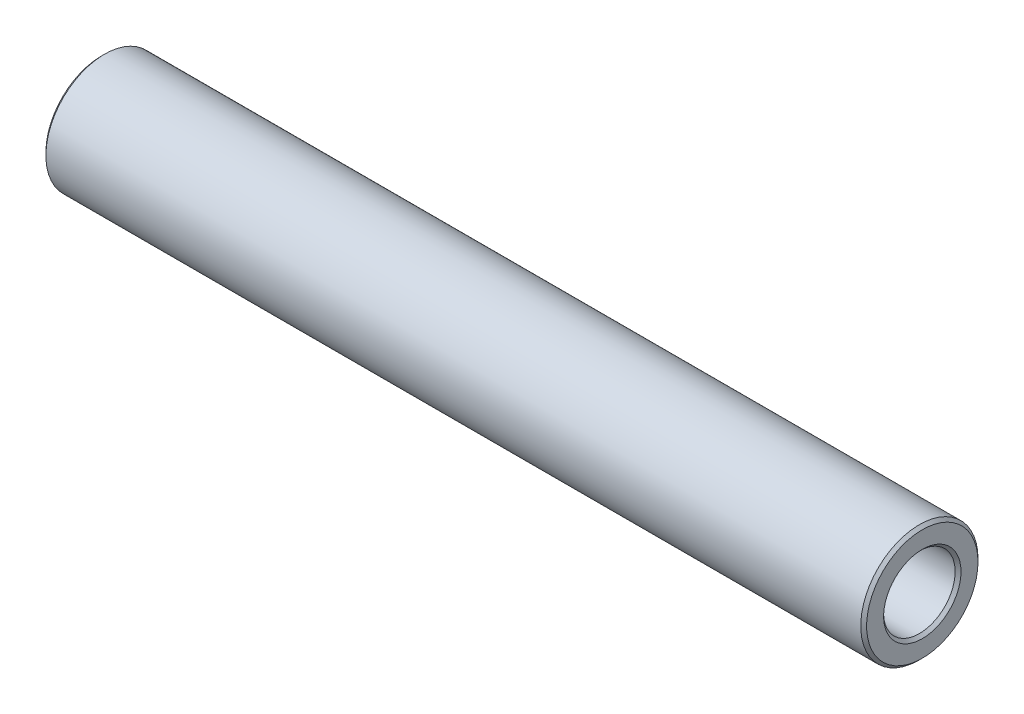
ISO-10303-21;
HEADER;
FILE_DESCRIPTION(('STEP AP214'),'2;1');
FILE_NAME('part.step','',(''),(''),'','','');
FILE_SCHEMA(('AUTOMOTIVE_DESIGN { 1 0 10303 214 1 1 1 1 }'));
ENDSEC;
DATA;
#1=APPLICATION_CONTEXT('core data for automotive mechanical design processes');
#2=APPLICATION_PROTOCOL_DEFINITION('international standard','automotive_design',2000,#1);
#3=PRODUCT_CONTEXT('',#1,'mechanical');
#4=PRODUCT('Part','Part','',(#3));
#5=PRODUCT_RELATED_PRODUCT_CATEGORY('part','',(#4));
#6=PRODUCT_DEFINITION_FORMATION('','',#4);
#7=PRODUCT_DEFINITION_CONTEXT('part definition',#1,'design');
#8=PRODUCT_DEFINITION('design','',#6,#7);
#9=PRODUCT_DEFINITION_SHAPE('','',#8);
#10=(LENGTH_UNIT() NAMED_UNIT(*) SI_UNIT(.MILLI.,.METRE.));
#11=(NAMED_UNIT(*) PLANE_ANGLE_UNIT() SI_UNIT($,.RADIAN.));
#12=(NAMED_UNIT(*) SI_UNIT($,.STERADIAN.) SOLID_ANGLE_UNIT());
#13=UNCERTAINTY_MEASURE_WITH_UNIT(LENGTH_MEASURE(1.E-05),#10,'distance_accuracy_value','');
#14=(GEOMETRIC_REPRESENTATION_CONTEXT(3) GLOBAL_UNCERTAINTY_ASSIGNED_CONTEXT((#13)) GLOBAL_UNIT_ASSIGNED_CONTEXT((#10,
#11,#12)) REPRESENTATION_CONTEXT('',''));
#15=CARTESIAN_POINT('',(0.,0.,0.));
#16=DIRECTION('',(0.,0.,1.));
#17=DIRECTION('',(1.,0.,0.));
#18=AXIS2_PLACEMENT_3D('',#15,#16,#17);
#19=CARTESIAN_POINT('',(70.,0.,0.));
#20=DIRECTION('',(1.,0.,0.));
#21=DIRECTION('',(0.,0.,-1.));
#22=AXIS2_PLACEMENT_3D('',#19,#20,#21);
#23=PLANE('',#22);
#24=CARTESIAN_POINT('',(70.,0.,0.));
#25=DIRECTION('',(1.,0.,0.));
#26=DIRECTION('',(0.,0.,-1.));
#27=AXIS2_PLACEMENT_3D('',#24,#25,#26);
#28=CIRCLE('',#27,3.3);
#29=CARTESIAN_POINT('',(70.,0.,-3.3));
#30=VERTEX_POINT('',#29);
#31=EDGE_CURVE('E39',#30,#30,#28,.F.);
#32=ORIENTED_EDGE('',*,*,#31,.T.);
#33=EDGE_LOOP('',(#32));
#34=FACE_BOUND('',#33,.T.);
#35=CARTESIAN_POINT('',(70.,0.,0.));
#36=DIRECTION('',(1.,0.,0.));
#37=DIRECTION('',(0.,0.,-1.));
#38=AXIS2_PLACEMENT_3D('',#35,#36,#37);
#39=CIRCLE('',#38,4.75);
#40=CARTESIAN_POINT('',(70.,0.,-4.75));
#41=VERTEX_POINT('',#40);
#42=EDGE_CURVE('E43',#41,#41,#39,.T.);
#43=ORIENTED_EDGE('',*,*,#42,.T.);
#44=EDGE_LOOP('',(#43));
#45=FACE_BOUND('',#44,.T.);
#46=ADVANCED_FACE('F28',(#34,#45),#23,.T.);
#47=CARTESIAN_POINT('',(0.,0.,0.));
#48=DIRECTION('',(1.,0.,0.));
#49=DIRECTION('',(0.,0.,-1.));
#50=AXIS2_PLACEMENT_3D('',#47,#48,#49);
#51=PLANE('',#50);
#52=CARTESIAN_POINT('',(0.,0.,0.));
#53=DIRECTION('',(1.,0.,0.));
#54=DIRECTION('',(0.,0.,-1.));
#55=AXIS2_PLACEMENT_3D('',#52,#53,#54);
#56=CIRCLE('',#55,3.30000000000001);
#57=CARTESIAN_POINT('',(0.,0.,-3.30000000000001));
#58=VERTEX_POINT('',#57);
#59=EDGE_CURVE('E54',#58,#58,#56,.T.);
#60=ORIENTED_EDGE('',*,*,#59,.T.);
#61=EDGE_LOOP('',(#60));
#62=FACE_BOUND('',#61,.T.);
#63=CARTESIAN_POINT('',(0.,0.,0.));
#64=DIRECTION('',(1.,0.,0.));
#65=DIRECTION('',(0.,0.,-1.));
#66=AXIS2_PLACEMENT_3D('',#63,#64,#65);
#67=CIRCLE('',#66,4.75);
#68=CARTESIAN_POINT('',(0.,0.,-4.75));
#69=VERTEX_POINT('',#68);
#70=EDGE_CURVE('E57',#69,#69,#67,.F.);
#71=ORIENTED_EDGE('',*,*,#70,.T.);
#72=EDGE_LOOP('',(#71));
#73=FACE_BOUND('',#72,.T.);
#74=ADVANCED_FACE('F61',(#62,#73),#51,.F.);
#75=CARTESIAN_POINT('',(70.,0.,0.));
#76=DIRECTION('',(-1.,0.,0.));
#77=DIRECTION('',(0.,0.,1.));
#78=AXIS2_PLACEMENT_3D('',#75,#76,#77);
#79=CYLINDRICAL_SURFACE('',#78,5.);
#80=CARTESIAN_POINT('',(0.25,0.,0.));
#81=DIRECTION('',(1.,0.,0.));
#82=DIRECTION('',(0.,0.,-1.));
#83=AXIS2_PLACEMENT_3D('',#80,#81,#82);
#84=CIRCLE('',#83,5.);
#85=CARTESIAN_POINT('',(0.25,0.,-5.));
#86=VERTEX_POINT('',#85);
#87=EDGE_CURVE('E10',#86,#86,#84,.T.);
#88=ORIENTED_EDGE('',*,*,#87,.T.);
#89=EDGE_LOOP('',(#88));
#90=FACE_BOUND('',#89,.T.);
#91=CARTESIAN_POINT('',(69.75,0.,0.));
#92=DIRECTION('',(1.,0.,0.));
#93=DIRECTION('',(0.,0.,-1.));
#94=AXIS2_PLACEMENT_3D('',#91,#92,#93);
#95=CIRCLE('',#94,5.);
#96=CARTESIAN_POINT('',(69.75,0.,-5.));
#97=VERTEX_POINT('',#96);
#98=EDGE_CURVE('E35',#97,#97,#95,.F.);
#99=ORIENTED_EDGE('',*,*,#98,.T.);
#100=EDGE_LOOP('',(#99));
#101=FACE_BOUND('',#100,.T.);
#102=ADVANCED_FACE('F81',(#90,#101),#79,.T.);
#103=CARTESIAN_POINT('',(70.,0.,0.));
#104=DIRECTION('',(-1.,0.,0.));
#105=DIRECTION('',(0.,0.,1.));
#106=AXIS2_PLACEMENT_3D('',#103,#104,#105);
#107=CYLINDRICAL_SURFACE('',#106,3.05);
#108=CARTESIAN_POINT('',(0.250000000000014,0.,0.));
#109=DIRECTION('',(1.,0.,0.));
#110=DIRECTION('',(0.,0.,-1.));
#111=AXIS2_PLACEMENT_3D('',#108,#109,#110);
#112=CIRCLE('',#111,3.05);
#113=CARTESIAN_POINT('',(0.250000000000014,0.,-3.05));
#114=VERTEX_POINT('',#113);
#115=EDGE_CURVE('E48',#114,#114,#112,.F.);
#116=ORIENTED_EDGE('',*,*,#115,.T.);
#117=EDGE_LOOP('',(#116));
#118=FACE_BOUND('',#117,.T.);
#119=CARTESIAN_POINT('',(69.75,0.,0.));
#120=DIRECTION('',(1.,0.,0.));
#121=DIRECTION('',(0.,0.,-1.));
#122=AXIS2_PLACEMENT_3D('',#119,#120,#121);
#123=CIRCLE('',#122,3.05);
#124=CARTESIAN_POINT('',(69.75,0.,-3.05));
#125=VERTEX_POINT('',#124);
#126=EDGE_CURVE('E51',#125,#125,#123,.T.);
#127=ORIENTED_EDGE('',*,*,#126,.T.);
#128=EDGE_LOOP('',(#127));
#129=FACE_BOUND('',#128,.T.);
#130=ADVANCED_FACE('F86',(#118,#129),#107,.F.);
#131=CARTESIAN_POINT('',(0.,0.,0.));
#132=DIRECTION('',(-1.,0.,0.));
#133=DIRECTION('',(0.,0.,1.));
#134=AXIS2_PLACEMENT_3D('',#131,#132,#133);
#135=CONICAL_SURFACE('',#134,3.30000000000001,0.785398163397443);
#136=ORIENTED_EDGE('',*,*,#115,.F.);
#137=EDGE_LOOP('',(#136));
#138=FACE_BOUND('',#137,.T.);
#139=ORIENTED_EDGE('',*,*,#59,.F.);
#140=EDGE_LOOP('',(#139));
#141=FACE_BOUND('',#140,.T.);
#142=ADVANCED_FACE('F72',(#138,#141),#135,.F.);
#143=CARTESIAN_POINT('',(69.75,0.,0.));
#144=DIRECTION('',(1.,0.,0.));
#145=DIRECTION('',(0.,0.,-1.));
#146=AXIS2_PLACEMENT_3D('',#143,#144,#145);
#147=CONICAL_SURFACE('',#146,3.05,0.785398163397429);
#148=ORIENTED_EDGE('',*,*,#31,.F.);
#149=EDGE_LOOP('',(#148));
#150=FACE_BOUND('',#149,.T.);
#151=ORIENTED_EDGE('',*,*,#126,.F.);
#152=EDGE_LOOP('',(#151));
#153=FACE_BOUND('',#152,.T.);
#154=ADVANCED_FACE('F66',(#150,#153),#147,.F.);
#155=CARTESIAN_POINT('',(0.25,0.,0.));
#156=DIRECTION('',(1.,0.,0.));
#157=DIRECTION('',(0.,0.,-1.));
#158=AXIS2_PLACEMENT_3D('',#155,#156,#157);
#159=CONICAL_SURFACE('',#158,5.,0.78539816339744);
#160=ORIENTED_EDGE('',*,*,#70,.F.);
#161=EDGE_LOOP('',(#160));
#162=FACE_BOUND('',#161,.T.);
#163=ORIENTED_EDGE('',*,*,#87,.F.);
#164=EDGE_LOOP('',(#163));
#165=FACE_BOUND('',#164,.T.);
#166=ADVANCED_FACE('F63',(#162,#165),#159,.T.);
#167=CARTESIAN_POINT('',(70.,0.,0.));
#168=DIRECTION('',(-1.,0.,0.));
#169=DIRECTION('',(0.,0.,1.));
#170=AXIS2_PLACEMENT_3D('',#167,#168,#169);
#171=CONICAL_SURFACE('',#170,4.75,0.78539816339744);
#172=ORIENTED_EDGE('',*,*,#98,.F.);
#173=EDGE_LOOP('',(#172));
#174=FACE_BOUND('',#173,.T.);
#175=ORIENTED_EDGE('',*,*,#42,.F.);
#176=EDGE_LOOP('',(#175));
#177=FACE_BOUND('',#176,.T.);
#178=ADVANCED_FACE('F30',(#174,#177),#171,.T.);
#179=CLOSED_SHELL('',(#46,#74,#102,#130,#142,#154,#166,#178));
#180=MANIFOLD_SOLID_BREP('B2',#179);
#181=ADVANCED_BREP_SHAPE_REPRESENTATION('',(#18,#180),#14);
#182=SHAPE_DEFINITION_REPRESENTATION(#9,#181);
ENDSEC;
END-ISO-10303-21;
